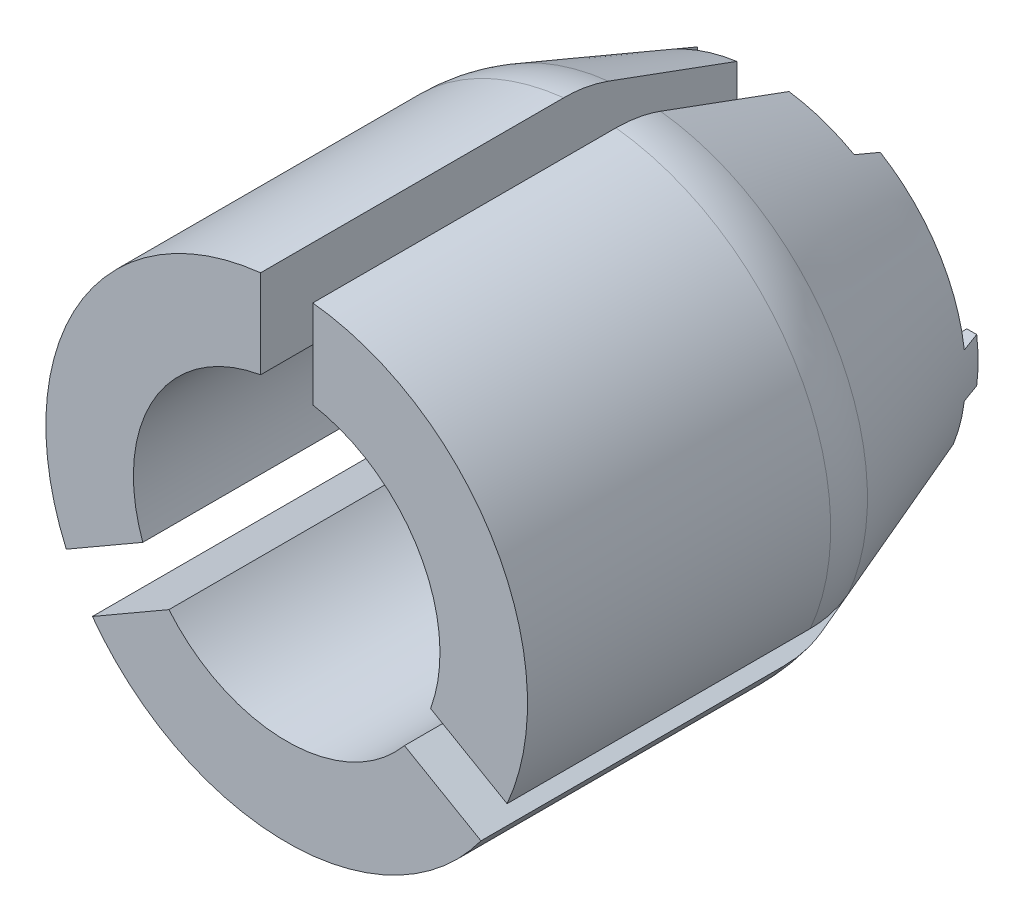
from build123d import *

# Parameters (mm, degrees)
SKIZZE1_R                       = 13
LINEAR_AUSTRAGEN1_DEPTH         = 15
LINEAR_AUSTRAGEN1_DRAFT         = -20
SKIZZE3_R                       = 12.25
SCHNITT_LINEAR_AUSTRAGEN1_DEPTH = 3.5
SKIZZE4_W                       = 4
SKIZZE4_H                       = 20
SCHNITT_LINEAR_AUSTRAGEN2_DEPTH = 31.108308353
SKIZZE6_R                       = 11.75
SCHNITT_LINEAR_AUSTRAGEN3_DEPTH = 31.108308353
SCHNITT_LINEAR_AUSTRAGEN5_DEPTH = 1.5
SKIZZE10_W                      = 14
SKIZZE10_H                      = 30
SCHNITT_LINEAR_AUSTRAGEN6_DEPTH = 2
LINEAR_AUSTRAGEN3_DEPTH         = 25
VERRUNDUNG1_R                   = 10
SCHNITT_LINEAR_AUSTRAGEN7_DEPTH = 48.76515798


with BuildPart() as part:
    # Skizze1 → Linear austragen1 (with draft: the straight prism first)
    with BuildSketch(Plane.XY):
        Circle(SKIZZE1_R)
    extrude(amount=LINEAR_AUSTRAGEN1_DEPTH)
    # Linear austragen1: the draft: its side faces are tilted about the plane it starts from
    linear_austragen1_sides = [part.faces().sort_by_distance(p)[0] for p in [
        (-13, 0, 7.5),
    ]]
    draft(linear_austragen1_sides, Plane.XY, LINEAR_AUSTRAGEN1_DRAFT)

    # Skizze3 → Schnitt-Linear austragen1 (cut)
    with BuildSketch(Plane(origin=(0, 0, 0), x_dir=(-1, 0, 0), z_dir=(0, 0, -1))):
        Circle(SKIZZE3_R)
    extrude(amount=-SCHNITT_LINEAR_AUSTRAGEN1_DEPTH, mode=Mode.SUBTRACT)

    # Skizze4 → Schnitt-Linear austragen2 (cut, through all)
    with BuildSketch(Plane(origin=(0, 0, 0), x_dir=(-1, 0, 0), z_dir=(0, 0, -1))):
        with Locations((0, 15)):
            Rectangle(SKIZZE4_W, SKIZZE4_H)
    extrude(amount=-SCHNITT_LINEAR_AUSTRAGEN2_DEPTH, mode=Mode.SUBTRACT)

    # Skizze6 → Schnitt-Linear austragen3 (cut, through all)
    with BuildSketch(Plane(origin=(0, 0, 0), x_dir=(-1, 0, 0), z_dir=(0, 0, -1))):
        Circle(SKIZZE6_R)
    extrude(amount=-SCHNITT_LINEAR_AUSTRAGEN3_DEPTH, mode=Mode.SUBTRACT)

    # Skizze7 → Schnitt-Linear austragen5 (cut)
    with BuildSketch(Plane(origin=(0, 0, 0), x_dir=(-1, 0, 0), z_dir=(0, 0, -1))):
        with BuildLine():
            Line((-12.131467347, 1.7), (-19.927619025, 1.7))
            ThreePointArc((-19.927619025, 1.7), (0, 20), (19.927619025, 1.7))
            Line((19.927619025, 1.7), (12.131467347, 1.7))
            ThreePointArc((12.131467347, 1.7), (0, 12.25), (-12.131467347, 1.7))
        make_face()
        with BuildLine():
            Line((-12.131467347, -1.7), (-19.927619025, -1.7))
            ThreePointArc((-19.927619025, -1.7), (0, -20), (19.927619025, -1.7))
            Line((19.927619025, -1.7), (12.131467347, -1.7))
            ThreePointArc((12.131467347, -1.7), (0, -12.25), (-12.131467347, -1.7))
        make_face()
    extrude(amount=-SCHNITT_LINEAR_AUSTRAGEN5_DEPTH, mode=Mode.SUBTRACT)

    # Skizze10 → Schnitt-Linear austragen6 (cut)
    with BuildSketch(Plane(origin=(0, 0, 1.5), x_dir=(-1, 0, 0), z_dir=(0, 0, -1))):
        Rectangle(SKIZZE10_W, SKIZZE10_H)
    extrude(amount=-SCHNITT_LINEAR_AUSTRAGEN6_DEPTH, mode=Mode.SUBTRACT)

    # Skizze12 → Linear austragen3 (add)
    with BuildSketch(Plane.XY.offset(15)):
        with BuildLine():
            Line((-2, 11.578536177), (-2, 18.350888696))
            ThreePointArc((-2, 18.350888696), (0, -18.459553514), (2, 18.350888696))
            Line((2, 18.350888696), (2, 11.578536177))
            ThreePointArc((2, 11.578536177), (0, -11.75), (-2, 11.578536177))
        make_face()
    extrude(amount=LINEAR_AUSTRAGEN3_DEPTH)

    # Verrundung1
    verrundung1_edges = [part.edges().sort_by_distance(p)[0] for p in [
        (0, -18.459553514, 15),
    ]]
    fillet(verrundung1_edges, radius=VERRUNDUNG1_R)

    # Skizze13 → Schnitt-Linear austragen7 (cut, through all)
    with BuildSketch(Plane.XY.offset(40)):
        Polygon((-2, 1.154700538), (-2, 18.459553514), (2, 18.459553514), (2, 1.154700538), (16.986442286, -7.497725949), (14.986442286, -10.961827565), (0, -2.309401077), (-14.986442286, -10.961827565), (-16.986442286, -7.497725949), align=None)
    extrude(amount=-SCHNITT_LINEAR_AUSTRAGEN7_DEPTH, mode=Mode.SUBTRACT)


with BuildPart() as schnitt_linear_austragen7_piece_1:
    # of the separate pieces the step leaves, piece 1, a body of its own (schnitt_linear_austragen7_pieces)
    add(part.part.solids().sort_by_distance((-16.366856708, -7.140008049, 13.34306829))[0])


with BuildPart() as schnitt_linear_austragen7_piece_2:
    # of the separate pieces the step leaves, piece 2, a body of its own (schnitt_linear_austragen7_pieces)
    add(part.part.solids().sort_by_distance((2, 17.744122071, 13.343068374))[0])


with BuildPart() as schnitt_linear_austragen7_piece_3:
    # of the separate pieces the step leaves, piece 3, a body of its own (schnitt_linear_austragen7_pieces)
    add(part.part.solids().sort_by_distance((14.366861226, -10.604112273, 13.343068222))[0])


solid = Compound([schnitt_linear_austragen7_piece_1.part, schnitt_linear_austragen7_piece_2.part, schnitt_linear_austragen7_piece_3.part])
